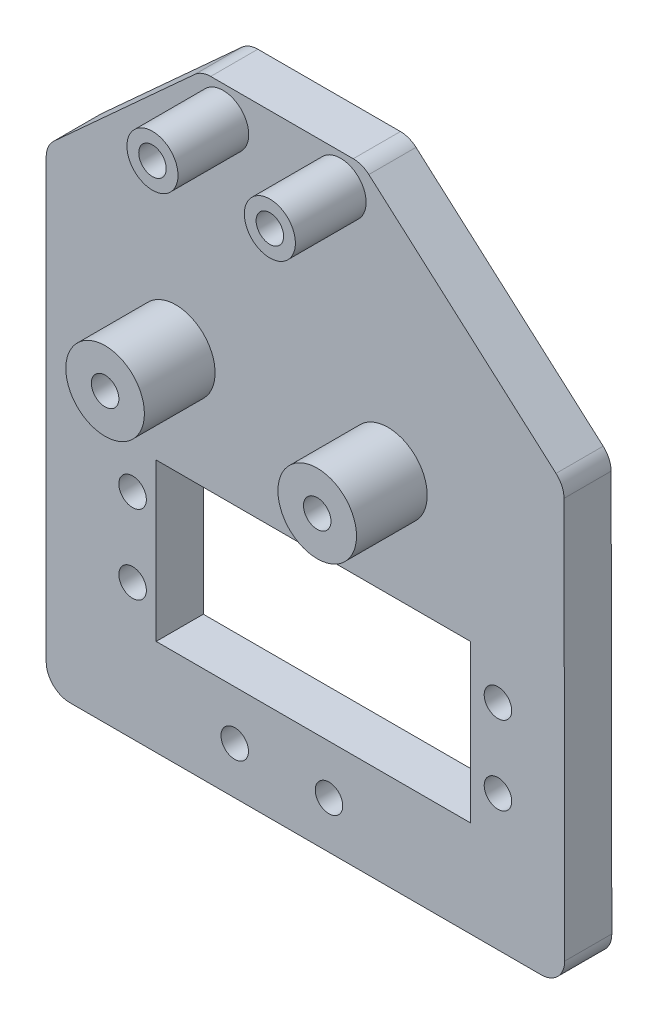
ISO-10303-21;
HEADER;
FILE_DESCRIPTION(('STEP AP214'),'2;1');
FILE_NAME('part.step','',(''),(''),'','','');
FILE_SCHEMA(('AUTOMOTIVE_DESIGN { 1 0 10303 214 1 1 1 1 }'));
ENDSEC;
DATA;
#1=APPLICATION_CONTEXT('core data for automotive mechanical design processes');
#2=APPLICATION_PROTOCOL_DEFINITION('international standard','automotive_design',2000,#1);
#3=PRODUCT_CONTEXT('',#1,'mechanical');
#4=PRODUCT('Part','Part','',(#3));
#5=PRODUCT_RELATED_PRODUCT_CATEGORY('part','',(#4));
#6=PRODUCT_DEFINITION_FORMATION('','',#4);
#7=PRODUCT_DEFINITION_CONTEXT('part definition',#1,'design');
#8=PRODUCT_DEFINITION('design','',#6,#7);
#9=PRODUCT_DEFINITION_SHAPE('','',#8);
#10=(LENGTH_UNIT() NAMED_UNIT(*) SI_UNIT(.MILLI.,.METRE.));
#11=(NAMED_UNIT(*) PLANE_ANGLE_UNIT() SI_UNIT($,.RADIAN.));
#12=(NAMED_UNIT(*) SI_UNIT($,.STERADIAN.) SOLID_ANGLE_UNIT());
#13=UNCERTAINTY_MEASURE_WITH_UNIT(LENGTH_MEASURE(1.E-05),#10,'distance_accuracy_value','');
#14=(GEOMETRIC_REPRESENTATION_CONTEXT(3) GLOBAL_UNCERTAINTY_ASSIGNED_CONTEXT((#13)) GLOBAL_UNIT_ASSIGNED_CONTEXT((#10,
#11,#12)) REPRESENTATION_CONTEXT('',''));
#15=CARTESIAN_POINT('',(0.,0.,0.));
#16=DIRECTION('',(0.,0.,1.));
#17=DIRECTION('',(1.,0.,0.));
#18=AXIS2_PLACEMENT_3D('',#15,#16,#17);
#19=CARTESIAN_POINT('',(0.,0.,3.));
#20=DIRECTION('',(0.,0.,-1.));
#21=DIRECTION('',(-1.,0.,0.));
#22=AXIS2_PLACEMENT_3D('',#19,#20,#21);
#23=PLANE('',#22);
#24=CARTESIAN_POINT('',(7.47053789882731,74.,3.));
#25=DIRECTION('',(0.,0.,-1.));
#26=DIRECTION('',(-1.,0.,0.));
#27=AXIS2_PLACEMENT_3D('',#24,#25,#26);
#28=CIRCLE('',#27,3.25);
#29=CARTESIAN_POINT('',(4.22053789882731,74.,3.));
#30=VERTEX_POINT('',#29);
#31=EDGE_CURVE('E282',#30,#30,#28,.F.);
#32=ORIENTED_EDGE('',*,*,#31,.F.);
#33=EDGE_LOOP('',(#32));
#34=FACE_BOUND('',#33,.T.);
#35=CARTESIAN_POINT('',(-7.47053789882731,74.,3.));
#36=DIRECTION('',(0.,0.,-1.));
#37=DIRECTION('',(-1.,0.,0.));
#38=AXIS2_PLACEMENT_3D('',#35,#36,#37);
#39=CIRCLE('',#38,3.25);
#40=CARTESIAN_POINT('',(-10.7205378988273,74.,3.));
#41=VERTEX_POINT('',#40);
#42=EDGE_CURVE('E279',#41,#41,#39,.F.);
#43=ORIENTED_EDGE('',*,*,#42,.F.);
#44=EDGE_LOOP('',(#43));
#45=FACE_BOUND('',#44,.T.);
#46=CARTESIAN_POINT('',(13.5,45.605,3.));
#47=DIRECTION('',(0.,0.,-1.));
#48=DIRECTION('',(-1.,0.,0.));
#49=AXIS2_PLACEMENT_3D('',#46,#47,#48);
#50=CIRCLE('',#49,5.);
#51=CARTESIAN_POINT('',(8.5,45.605,3.));
#52=VERTEX_POINT('',#51);
#53=EDGE_CURVE('E276',#52,#52,#50,.F.);
#54=ORIENTED_EDGE('',*,*,#53,.F.);
#55=EDGE_LOOP('',(#54));
#56=FACE_BOUND('',#55,.T.);
#57=CARTESIAN_POINT('',(-13.5,45.605,3.));
#58=DIRECTION('',(0.,0.,-1.));
#59=DIRECTION('',(-1.,0.,0.));
#60=AXIS2_PLACEMENT_3D('',#57,#58,#59);
#61=CIRCLE('',#60,5.);
#62=CARTESIAN_POINT('',(-18.5,45.605,3.));
#63=VERTEX_POINT('',#62);
#64=EDGE_CURVE('E258',#63,#63,#61,.F.);
#65=ORIENTED_EDGE('',*,*,#64,.F.);
#66=EDGE_LOOP('',(#65));
#67=FACE_BOUND('',#66,.T.);
#68=CARTESIAN_POINT('',(-19.,27.25,3.));
#69=DIRECTION('',(0.,0.,1.));
#70=DIRECTION('',(-1.,0.,0.));
#71=AXIS2_PLACEMENT_3D('',#68,#69,#70);
#72=CIRCLE('',#71,1.75);
#73=CARTESIAN_POINT('',(-20.75,27.25,3.));
#74=VERTEX_POINT('',#73);
#75=EDGE_CURVE('E198',#74,#74,#72,.T.);
#76=ORIENTED_EDGE('',*,*,#75,.F.);
#77=EDGE_LOOP('',(#76));
#78=FACE_BOUND('',#77,.T.);
#79=CARTESIAN_POINT('',(27.5,17.25,3.));
#80=DIRECTION('',(0.,0.,1.));
#81=DIRECTION('',(-1.,0.,0.));
#82=AXIS2_PLACEMENT_3D('',#79,#80,#81);
#83=CIRCLE('',#82,1.75);
#84=CARTESIAN_POINT('',(25.75,17.25,3.));
#85=VERTEX_POINT('',#84);
#86=EDGE_CURVE('E205',#85,#85,#83,.T.);
#87=ORIENTED_EDGE('',*,*,#86,.F.);
#88=EDGE_LOOP('',(#87));
#89=FACE_BOUND('',#88,.T.);
#90=CARTESIAN_POINT('',(-19.,17.25,3.));
#91=DIRECTION('',(0.,0.,1.));
#92=DIRECTION('',(1.,0.,0.));
#93=AXIS2_PLACEMENT_3D('',#90,#91,#92);
#94=CIRCLE('',#93,1.75);
#95=CARTESIAN_POINT('',(-17.25,17.25,3.));
#96=VERTEX_POINT('',#95);
#97=EDGE_CURVE('E183',#96,#96,#94,.T.);
#98=ORIENTED_EDGE('',*,*,#97,.F.);
#99=EDGE_LOOP('',(#98));
#100=FACE_BOUND('',#99,.T.);
#101=DIRECTION('',(1.,0.,0.));
#102=VECTOR('',#101,1.);
#103=CARTESIAN_POINT('',(-16.,12.25,3.));
#104=LINE('',#103,#102);
#105=CARTESIAN_POINT('',(-16.,12.25,3.));
#106=VERTEX_POINT('',#105);
#107=CARTESIAN_POINT('',(24.,12.25,3.));
#108=VERTEX_POINT('',#107);
#109=EDGE_CURVE('E179',#106,#108,#104,.T.);
#110=ORIENTED_EDGE('',*,*,#109,.F.);
#111=DIRECTION('',(0.,-1.,0.));
#112=VECTOR('',#111,1.);
#113=CARTESIAN_POINT('',(-16.,32.25,3.));
#114=LINE('',#113,#112);
#115=CARTESIAN_POINT('',(-16.,32.25,3.));
#116=VERTEX_POINT('',#115);
#117=EDGE_CURVE('E158',#116,#106,#114,.T.);
#118=ORIENTED_EDGE('',*,*,#117,.F.);
#119=DIRECTION('',(-1.,0.,0.));
#120=VECTOR('',#119,1.);
#121=CARTESIAN_POINT('',(-16.,32.25,3.));
#122=LINE('',#121,#120);
#123=CARTESIAN_POINT('',(24.,32.25,3.));
#124=VERTEX_POINT('',#123);
#125=EDGE_CURVE('E169',#124,#116,#122,.T.);
#126=ORIENTED_EDGE('',*,*,#125,.F.);
#127=DIRECTION('',(0.,1.,0.));
#128=VECTOR('',#127,1.);
#129=CARTESIAN_POINT('',(24.,32.25,3.));
#130=LINE('',#129,#128);
#131=EDGE_CURVE('E174',#108,#124,#130,.T.);
#132=ORIENTED_EDGE('',*,*,#131,.F.);
#133=EDGE_LOOP('',(#110,#118,#126,#132));
#134=FACE_BOUND('',#133,.T.);
#135=CARTESIAN_POINT('',(27.5,27.25,3.));
#136=DIRECTION('',(0.,0.,1.));
#137=DIRECTION('',(1.,0.,0.));
#138=AXIS2_PLACEMENT_3D('',#135,#136,#137);
#139=CIRCLE('',#138,1.75);
#140=CARTESIAN_POINT('',(29.25,27.25,3.));
#141=VERTEX_POINT('',#140);
#142=EDGE_CURVE('E201',#141,#141,#139,.T.);
#143=ORIENTED_EDGE('',*,*,#142,.F.);
#144=EDGE_LOOP('',(#143));
#145=FACE_BOUND('',#144,.T.);
#146=DIRECTION('',(-0.00168143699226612,0.999998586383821,0.));
#147=VECTOR('',#146,1.);
#148=CARTESIAN_POINT('',(35.9069763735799,55.3238065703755,3.));
#149=LINE('',#148,#147);
#150=CARTESIAN_POINT('',(35.9949472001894,3.00504431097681,3.));
#151=VERTEX_POINT('',#150);
#152=CARTESIAN_POINT('',(35.9092468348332,53.9734984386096,3.));
#153=VERTEX_POINT('',#152);
#154=EDGE_CURVE('E244',#151,#153,#149,.T.);
#155=ORIENTED_EDGE('',*,*,#154,.T.);
#156=CARTESIAN_POINT('',(32.9092510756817,53.9684541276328,3.));
#157=DIRECTION('',(0.,0.,-1.));
#158=DIRECTION('',(-1.,0.,0.));
#159=AXIS2_PLACEMENT_3D('',#156,#157,#158);
#160=CIRCLE('',#159,3.);
#161=CARTESIAN_POINT('',(34.8946913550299,56.2174598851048,3.));
#162=VERTEX_POINT('',#161);
#163=EDGE_CURVE('E316',#153,#162,#160,.F.);
#164=ORIENTED_EDGE('',*,*,#163,.T.);
#165=DIRECTION('',(-0.749668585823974,0.661813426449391,0.));
#166=VECTOR('',#165,1.);
#167=CARTESIAN_POINT('',(10.2205378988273,78.,3.));
#168=LINE('',#167,#166);
#169=CARTESIAN_POINT('',(11.0712259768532,77.2490057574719,3.));
#170=VERTEX_POINT('',#169);
#171=EDGE_CURVE('E248',#162,#170,#168,.T.);
#172=ORIENTED_EDGE('',*,*,#171,.T.);
#173=CARTESIAN_POINT('',(9.08578569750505,75.,3.));
#174=DIRECTION('',(0.,0.,-1.));
#175=DIRECTION('',(-1.,0.,0.));
#176=AXIS2_PLACEMENT_3D('',#173,#174,#175);
#177=CIRCLE('',#176,3.);
#178=CARTESIAN_POINT('',(9.08578569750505,78.,3.));
#179=VERTEX_POINT('',#178);
#180=EDGE_CURVE('E312',#170,#179,#177,.F.);
#181=ORIENTED_EDGE('',*,*,#180,.T.);
#182=DIRECTION('',(-1.,0.,0.));
#183=VECTOR('',#182,1.);
#184=CARTESIAN_POINT('',(-10.2205378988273,78.,3.));
#185=LINE('',#184,#183);
#186=CARTESIAN_POINT('',(-9.05982649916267,78.,3.));
#187=VERTEX_POINT('',#186);
#188=EDGE_CURVE('E251',#179,#187,#185,.T.);
#189=ORIENTED_EDGE('',*,*,#188,.T.);
#190=CARTESIAN_POINT('',(-9.05982649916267,75.,3.));
#191=DIRECTION('',(0.,0.,-1.));
#192=DIRECTION('',(-1.,0.,0.));
#193=AXIS2_PLACEMENT_3D('',#190,#191,#192);
#194=CIRCLE('',#193,3.);
#195=CARTESIAN_POINT('',(-11.0789913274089,77.2187774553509,3.));
#196=VERTEX_POINT('',#195);
#197=EDGE_CURVE('E309',#187,#196,#194,.F.);
#198=ORIENTED_EDGE('',*,*,#197,.T.);
#199=DIRECTION('',(-0.739592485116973,-0.673054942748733,0.));
#200=VECTOR('',#199,1.);
#201=CARTESIAN_POINT('',(-30.,60.,3.));
#202=LINE('',#201,#200);
#203=CARTESIAN_POINT('',(-29.0191648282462,60.8925941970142,3.));
#204=VERTEX_POINT('',#203);
#205=EDGE_CURVE('E254',#196,#204,#202,.T.);
#206=ORIENTED_EDGE('',*,*,#205,.T.);
#207=CARTESIAN_POINT('',(-27.,58.6738167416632,3.));
#208=DIRECTION('',(0.,0.,-1.));
#209=DIRECTION('',(-1.,0.,0.));
#210=AXIS2_PLACEMENT_3D('',#207,#208,#209);
#211=CIRCLE('',#210,3.);
#212=CARTESIAN_POINT('',(-30.,58.6738167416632,3.));
#213=VERTEX_POINT('',#212);
#214=EDGE_CURVE('E63',#204,#213,#211,.F.);
#215=ORIENTED_EDGE('',*,*,#214,.T.);
#216=DIRECTION('',(0.,-1.,0.));
#217=VECTOR('',#216,1.);
#218=CARTESIAN_POINT('',(-30.,30.,3.));
#219=LINE('',#218,#217);
#220=CARTESIAN_POINT('',(-30.,3.,3.));
#221=VERTEX_POINT('',#220);
#222=EDGE_CURVE('E256',#213,#221,#219,.T.);
#223=ORIENTED_EDGE('',*,*,#222,.T.);
#224=CARTESIAN_POINT('',(-27.,3.,3.));
#225=DIRECTION('',(0.,0.,-1.));
#226=DIRECTION('',(-1.,0.,0.));
#227=AXIS2_PLACEMENT_3D('',#224,#225,#226);
#228=CIRCLE('',#227,3.);
#229=CARTESIAN_POINT('',(-27.,0.,3.));
#230=VERTEX_POINT('',#229);
#231=EDGE_CURVE('E307',#221,#230,#228,.F.);
#232=ORIENTED_EDGE('',*,*,#231,.T.);
#233=DIRECTION('',(1.,0.,0.));
#234=VECTOR('',#233,1.);
#235=CARTESIAN_POINT('',(30.,0.,3.));
#236=LINE('',#235,#234);
#237=CARTESIAN_POINT('',(32.9949514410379,0.,3.));
#238=VERTEX_POINT('',#237);
#239=EDGE_CURVE('E241',#230,#238,#236,.T.);
#240=ORIENTED_EDGE('',*,*,#239,.T.);
#241=CARTESIAN_POINT('',(32.9949514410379,3.00000000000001,3.));
#242=DIRECTION('',(0.,0.,-1.));
#243=DIRECTION('',(-1.,0.,0.));
#244=AXIS2_PLACEMENT_3D('',#241,#242,#243);
#245=CIRCLE('',#244,3.);
#246=EDGE_CURVE('E314',#238,#151,#245,.F.);
#247=ORIENTED_EDGE('',*,*,#246,.T.);
#248=EDGE_LOOP('',(#155,#164,#172,#181,#189,#198,#206,#215,#223,#232,#240,#247));
#249=FACE_BOUND('',#248,.T.);
#250=CARTESIAN_POINT('',(-6.,6.,3.));
#251=DIRECTION('',(0.,0.,1.));
#252=DIRECTION('',(1.,0.,0.));
#253=AXIS2_PLACEMENT_3D('',#250,#251,#252);
#254=CIRCLE('',#253,1.75);
#255=CARTESIAN_POINT('',(-4.25,6.,3.));
#256=VERTEX_POINT('',#255);
#257=EDGE_CURVE('E232',#256,#256,#254,.T.);
#258=ORIENTED_EDGE('',*,*,#257,.F.);
#259=EDGE_LOOP('',(#258));
#260=FACE_BOUND('',#259,.T.);
#261=CARTESIAN_POINT('',(6.,6.,3.));
#262=DIRECTION('',(0.,0.,1.));
#263=DIRECTION('',(-1.,0.,0.));
#264=AXIS2_PLACEMENT_3D('',#261,#262,#263);
#265=CIRCLE('',#264,1.75);
#266=CARTESIAN_POINT('',(4.25,6.,3.));
#267=VERTEX_POINT('',#266);
#268=EDGE_CURVE('E223',#267,#267,#265,.T.);
#269=ORIENTED_EDGE('',*,*,#268,.F.);
#270=EDGE_LOOP('',(#269));
#271=FACE_BOUND('',#270,.T.);
#272=ADVANCED_FACE('F41',(#34,#45,#56,#67,#78,#89,#100,#134,#145,#249,#260,#271),#23,.F.);
#273=CARTESIAN_POINT('',(0.,0.,-3.));
#274=DIRECTION('',(0.,0.,-1.));
#275=DIRECTION('',(-1.,0.,0.));
#276=AXIS2_PLACEMENT_3D('',#273,#274,#275);
#277=PLANE('',#276);
#278=CARTESIAN_POINT('',(-19.,27.25,-3.));
#279=DIRECTION('',(0.,0.,1.));
#280=DIRECTION('',(-1.,0.,0.));
#281=AXIS2_PLACEMENT_3D('',#278,#279,#280);
#282=CIRCLE('',#281,1.75);
#283=CARTESIAN_POINT('',(-20.75,27.25,-3.));
#284=VERTEX_POINT('',#283);
#285=EDGE_CURVE('E202',#284,#284,#282,.T.);
#286=ORIENTED_EDGE('',*,*,#285,.T.);
#287=EDGE_LOOP('',(#286));
#288=FACE_BOUND('',#287,.T.);
#289=CARTESIAN_POINT('',(27.5,17.25,-3.));
#290=DIRECTION('',(0.,0.,1.));
#291=DIRECTION('',(-1.,0.,0.));
#292=AXIS2_PLACEMENT_3D('',#289,#290,#291);
#293=CIRCLE('',#292,1.75);
#294=CARTESIAN_POINT('',(25.75,17.25,-3.));
#295=VERTEX_POINT('',#294);
#296=EDGE_CURVE('E208',#295,#295,#293,.T.);
#297=ORIENTED_EDGE('',*,*,#296,.T.);
#298=EDGE_LOOP('',(#297));
#299=FACE_BOUND('',#298,.T.);
#300=CARTESIAN_POINT('',(-19.,17.25,-3.));
#301=DIRECTION('',(0.,0.,1.));
#302=DIRECTION('',(1.,0.,0.));
#303=AXIS2_PLACEMENT_3D('',#300,#301,#302);
#304=CIRCLE('',#303,1.75);
#305=CARTESIAN_POINT('',(-17.25,17.25,-3.));
#306=VERTEX_POINT('',#305);
#307=EDGE_CURVE('E180',#306,#306,#304,.T.);
#308=ORIENTED_EDGE('',*,*,#307,.T.);
#309=EDGE_LOOP('',(#308));
#310=FACE_BOUND('',#309,.T.);
#311=DIRECTION('',(0.,-1.,0.));
#312=VECTOR('',#311,1.);
#313=CARTESIAN_POINT('',(-16.,32.25,-3.));
#314=LINE('',#313,#312);
#315=CARTESIAN_POINT('',(-16.,32.25,-3.));
#316=VERTEX_POINT('',#315);
#317=CARTESIAN_POINT('',(-16.,12.25,-3.));
#318=VERTEX_POINT('',#317);
#319=EDGE_CURVE('E161',#316,#318,#314,.T.);
#320=ORIENTED_EDGE('',*,*,#319,.T.);
#321=DIRECTION('',(1.,0.,0.));
#322=VECTOR('',#321,1.);
#323=CARTESIAN_POINT('',(-16.,12.25,-3.));
#324=LINE('',#323,#322);
#325=CARTESIAN_POINT('',(24.,12.25,-3.));
#326=VERTEX_POINT('',#325);
#327=EDGE_CURVE('E194',#318,#326,#324,.T.);
#328=ORIENTED_EDGE('',*,*,#327,.T.);
#329=DIRECTION('',(0.,1.,0.));
#330=VECTOR('',#329,1.);
#331=CARTESIAN_POINT('',(24.,32.25,-3.));
#332=LINE('',#331,#330);
#333=CARTESIAN_POINT('',(24.,32.25,-3.));
#334=VERTEX_POINT('',#333);
#335=EDGE_CURVE('E190',#326,#334,#332,.T.);
#336=ORIENTED_EDGE('',*,*,#335,.T.);
#337=DIRECTION('',(-1.,0.,0.));
#338=VECTOR('',#337,1.);
#339=CARTESIAN_POINT('',(-16.,32.25,-3.));
#340=LINE('',#339,#338);
#341=EDGE_CURVE('E188',#334,#316,#340,.T.);
#342=ORIENTED_EDGE('',*,*,#341,.T.);
#343=EDGE_LOOP('',(#320,#328,#336,#342));
#344=FACE_BOUND('',#343,.T.);
#345=CARTESIAN_POINT('',(27.5,27.25,-3.));
#346=DIRECTION('',(0.,0.,1.));
#347=DIRECTION('',(1.,0.,0.));
#348=AXIS2_PLACEMENT_3D('',#345,#346,#347);
#349=CIRCLE('',#348,1.75);
#350=CARTESIAN_POINT('',(29.25,27.25,-3.));
#351=VERTEX_POINT('',#350);
#352=EDGE_CURVE('E211',#351,#351,#349,.T.);
#353=ORIENTED_EDGE('',*,*,#352,.T.);
#354=EDGE_LOOP('',(#353));
#355=FACE_BOUND('',#354,.T.);
#356=CARTESIAN_POINT('',(13.5,45.605,-3.));
#357=DIRECTION('',(0.,0.,1.));
#358=DIRECTION('',(-1.,0.,0.));
#359=AXIS2_PLACEMENT_3D('',#356,#357,#358);
#360=CIRCLE('',#359,1.75);
#361=CARTESIAN_POINT('',(11.75,45.605,-3.));
#362=VERTEX_POINT('',#361);
#363=EDGE_CURVE('E219',#362,#362,#360,.T.);
#364=ORIENTED_EDGE('',*,*,#363,.T.);
#365=EDGE_LOOP('',(#364));
#366=FACE_BOUND('',#365,.T.);
#367=CARTESIAN_POINT('',(-13.5,45.605,-3.));
#368=DIRECTION('',(0.,0.,1.));
#369=DIRECTION('',(1.,0.,0.));
#370=AXIS2_PLACEMENT_3D('',#367,#368,#369);
#371=CIRCLE('',#370,1.75);
#372=CARTESIAN_POINT('',(-11.75,45.605,-3.));
#373=VERTEX_POINT('',#372);
#374=EDGE_CURVE('E226',#373,#373,#371,.T.);
#375=ORIENTED_EDGE('',*,*,#374,.T.);
#376=EDGE_LOOP('',(#375));
#377=FACE_BOUND('',#376,.T.);
#378=CARTESIAN_POINT('',(-7.47053789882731,74.,-3.));
#379=DIRECTION('',(0.,0.,1.));
#380=DIRECTION('',(1.,0.,0.));
#381=AXIS2_PLACEMENT_3D('',#378,#379,#380);
#382=CIRCLE('',#381,1.75);
#383=CARTESIAN_POINT('',(-5.7205378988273,74.,-3.));
#384=VERTEX_POINT('',#383);
#385=EDGE_CURVE('E235',#384,#384,#382,.T.);
#386=ORIENTED_EDGE('',*,*,#385,.T.);
#387=EDGE_LOOP('',(#386));
#388=FACE_BOUND('',#387,.T.);
#389=DIRECTION('',(-0.749668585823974,0.661813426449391,0.));
#390=VECTOR('',#389,1.);
#391=CARTESIAN_POINT('',(10.2205378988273,78.,-3.));
#392=LINE('',#391,#390);
#393=CARTESIAN_POINT('',(34.8946913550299,56.2174598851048,-3.));
#394=VERTEX_POINT('',#393);
#395=CARTESIAN_POINT('',(11.0712259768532,77.2490057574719,-3.));
#396=VERTEX_POINT('',#395);
#397=EDGE_CURVE('E261',#394,#396,#392,.T.);
#398=ORIENTED_EDGE('',*,*,#397,.F.);
#399=CARTESIAN_POINT('',(32.9092510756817,53.9684541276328,-3.));
#400=DIRECTION('',(0.,0.,-1.));
#401=DIRECTION('',(-1.,0.,0.));
#402=AXIS2_PLACEMENT_3D('',#399,#400,#401);
#403=CIRCLE('',#402,3.);
#404=CARTESIAN_POINT('',(35.9092468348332,53.9734984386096,-3.));
#405=VERTEX_POINT('',#404);
#406=EDGE_CURVE('E300',#394,#405,#403,.T.);
#407=ORIENTED_EDGE('',*,*,#406,.T.);
#408=DIRECTION('',(-0.00168143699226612,0.999998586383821,0.));
#409=VECTOR('',#408,1.);
#410=CARTESIAN_POINT('',(35.9069763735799,55.3238065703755,-3.));
#411=LINE('',#410,#409);
#412=CARTESIAN_POINT('',(35.9949472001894,3.00504431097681,-3.));
#413=VERTEX_POINT('',#412);
#414=EDGE_CURVE('E240',#413,#405,#411,.T.);
#415=ORIENTED_EDGE('',*,*,#414,.F.);
#416=CARTESIAN_POINT('',(32.9949514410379,3.00000000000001,-3.));
#417=DIRECTION('',(0.,0.,-1.));
#418=DIRECTION('',(-1.,0.,0.));
#419=AXIS2_PLACEMENT_3D('',#416,#417,#418);
#420=CIRCLE('',#419,3.);
#421=CARTESIAN_POINT('',(32.9949514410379,0.,-3.));
#422=VERTEX_POINT('',#421);
#423=EDGE_CURVE('E298',#413,#422,#420,.T.);
#424=ORIENTED_EDGE('',*,*,#423,.T.);
#425=DIRECTION('',(1.,0.,0.));
#426=VECTOR('',#425,1.);
#427=CARTESIAN_POINT('',(0.,0.,-3.));
#428=LINE('',#427,#426);
#429=CARTESIAN_POINT('',(-27.,0.,-3.));
#430=VERTEX_POINT('',#429);
#431=EDGE_CURVE('E245',#430,#422,#428,.T.);
#432=ORIENTED_EDGE('',*,*,#431,.F.);
#433=CARTESIAN_POINT('',(-27.,3.,-3.));
#434=DIRECTION('',(0.,0.,-1.));
#435=DIRECTION('',(-1.,0.,0.));
#436=AXIS2_PLACEMENT_3D('',#433,#434,#435);
#437=CIRCLE('',#436,3.);
#438=CARTESIAN_POINT('',(-30.,3.,-3.));
#439=VERTEX_POINT('',#438);
#440=EDGE_CURVE('E290',#430,#439,#437,.T.);
#441=ORIENTED_EDGE('',*,*,#440,.T.);
#442=DIRECTION('',(0.,-1.,0.));
#443=VECTOR('',#442,1.);
#444=CARTESIAN_POINT('',(-30.,0.,-3.));
#445=LINE('',#444,#443);
#446=CARTESIAN_POINT('',(-30.,58.6738167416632,-3.));
#447=VERTEX_POINT('',#446);
#448=EDGE_CURVE('E270',#447,#439,#445,.T.);
#449=ORIENTED_EDGE('',*,*,#448,.F.);
#450=CARTESIAN_POINT('',(-27.,58.6738167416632,-3.));
#451=DIRECTION('',(0.,0.,-1.));
#452=DIRECTION('',(-1.,0.,0.));
#453=AXIS2_PLACEMENT_3D('',#450,#451,#452);
#454=CIRCLE('',#453,3.);
#455=CARTESIAN_POINT('',(-29.0191648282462,60.8925941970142,-3.));
#456=VERTEX_POINT('',#455);
#457=EDGE_CURVE('E294',#447,#456,#454,.T.);
#458=ORIENTED_EDGE('',*,*,#457,.T.);
#459=DIRECTION('',(-0.739592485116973,-0.673054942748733,0.));
#460=VECTOR('',#459,1.);
#461=CARTESIAN_POINT('',(-30.,60.,-3.));
#462=LINE('',#461,#460);
#463=CARTESIAN_POINT('',(-11.0789913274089,77.2187774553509,-3.));
#464=VERTEX_POINT('',#463);
#465=EDGE_CURVE('E267',#464,#456,#462,.T.);
#466=ORIENTED_EDGE('',*,*,#465,.F.);
#467=CARTESIAN_POINT('',(-9.05982649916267,75.,-3.));
#468=DIRECTION('',(0.,0.,-1.));
#469=DIRECTION('',(-1.,0.,0.));
#470=AXIS2_PLACEMENT_3D('',#467,#468,#469);
#471=CIRCLE('',#470,3.);
#472=CARTESIAN_POINT('',(-9.05982649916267,78.,-3.));
#473=VERTEX_POINT('',#472);
#474=EDGE_CURVE('E292',#464,#473,#471,.T.);
#475=ORIENTED_EDGE('',*,*,#474,.T.);
#476=DIRECTION('',(-1.,0.,0.));
#477=VECTOR('',#476,1.);
#478=CARTESIAN_POINT('',(-10.2205378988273,78.,-3.));
#479=LINE('',#478,#477);
#480=CARTESIAN_POINT('',(9.08578569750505,78.,-3.));
#481=VERTEX_POINT('',#480);
#482=EDGE_CURVE('E264',#481,#473,#479,.T.);
#483=ORIENTED_EDGE('',*,*,#482,.F.);
#484=CARTESIAN_POINT('',(9.08578569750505,75.,-3.));
#485=DIRECTION('',(0.,0.,-1.));
#486=DIRECTION('',(-1.,0.,0.));
#487=AXIS2_PLACEMENT_3D('',#484,#485,#486);
#488=CIRCLE('',#487,3.);
#489=EDGE_CURVE('E296',#481,#396,#488,.T.);
#490=ORIENTED_EDGE('',*,*,#489,.T.);
#491=EDGE_LOOP('',(#398,#407,#415,#424,#432,#441,#449,#458,#466,#475,#483,#490));
#492=FACE_BOUND('',#491,.T.);
#493=CARTESIAN_POINT('',(-6.,6.,-3.));
#494=DIRECTION('',(0.,0.,1.));
#495=DIRECTION('',(1.,0.,0.));
#496=AXIS2_PLACEMENT_3D('',#493,#494,#495);
#497=CIRCLE('',#496,1.75);
#498=CARTESIAN_POINT('',(-4.25,6.,-3.));
#499=VERTEX_POINT('',#498);
#500=EDGE_CURVE('E231',#499,#499,#497,.T.);
#501=ORIENTED_EDGE('',*,*,#500,.T.);
#502=EDGE_LOOP('',(#501));
#503=FACE_BOUND('',#502,.T.);
#504=CARTESIAN_POINT('',(6.,6.,-3.));
#505=DIRECTION('',(0.,0.,1.));
#506=DIRECTION('',(-1.,0.,0.));
#507=AXIS2_PLACEMENT_3D('',#504,#505,#506);
#508=CIRCLE('',#507,1.75);
#509=CARTESIAN_POINT('',(4.25,6.,-3.));
#510=VERTEX_POINT('',#509);
#511=EDGE_CURVE('E222',#510,#510,#508,.T.);
#512=ORIENTED_EDGE('',*,*,#511,.T.);
#513=EDGE_LOOP('',(#512));
#514=FACE_BOUND('',#513,.T.);
#515=CARTESIAN_POINT('',(7.47053789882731,74.,-3.));
#516=DIRECTION('',(0.,0.,1.));
#517=DIRECTION('',(-1.,0.,0.));
#518=AXIS2_PLACEMENT_3D('',#515,#516,#517);
#519=CIRCLE('',#518,1.75);
#520=CARTESIAN_POINT('',(5.7205378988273,74.,-3.));
#521=VERTEX_POINT('',#520);
#522=EDGE_CURVE('E214',#521,#521,#519,.T.);
#523=ORIENTED_EDGE('',*,*,#522,.T.);
#524=EDGE_LOOP('',(#523));
#525=FACE_BOUND('',#524,.T.);
#526=ADVANCED_FACE('F342',(#288,#299,#310,#344,#355,#366,#377,#388,#492,#503,#514,#525),#277,.T.);
#527=CARTESIAN_POINT('',(35.9069763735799,55.3238065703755,3.));
#528=DIRECTION('',(-0.999998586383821,-0.00168143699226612,0.));
#529=DIRECTION('',(0.00168143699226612,-0.999998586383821,0.));
#530=AXIS2_PLACEMENT_3D('',#527,#528,#529);
#531=PLANE('',#530);
#532=ORIENTED_EDGE('',*,*,#414,.T.);
#533=DIRECTION('',(0.,0.,-1.));
#534=VECTOR('',#533,1.);
#535=CARTESIAN_POINT('',(35.9092468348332,53.9734984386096,3.));
#536=LINE('',#535,#534);
#537=EDGE_CURVE('E305',#405,#153,#536,.F.);
#538=ORIENTED_EDGE('',*,*,#537,.T.);
#539=ORIENTED_EDGE('',*,*,#154,.F.);
#540=DIRECTION('',(0.,0.,-1.));
#541=VECTOR('',#540,1.);
#542=CARTESIAN_POINT('',(35.9949472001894,3.00504431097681,3.));
#543=LINE('',#542,#541);
#544=EDGE_CURVE('E302',#151,#413,#543,.T.);
#545=ORIENTED_EDGE('',*,*,#544,.T.);
#546=EDGE_LOOP('',(#532,#538,#539,#545));
#547=FACE_BOUND('',#546,.T.);
#548=ADVANCED_FACE('F366',(#547),#531,.F.);
#549=CARTESIAN_POINT('',(10.2205378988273,78.,3.));
#550=DIRECTION('',(-0.661813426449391,-0.749668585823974,0.));
#551=DIRECTION('',(0.749668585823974,-0.661813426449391,0.));
#552=AXIS2_PLACEMENT_3D('',#549,#550,#551);
#553=PLANE('',#552);
#554=ORIENTED_EDGE('',*,*,#171,.F.);
#555=DIRECTION('',(0.,0.,-1.));
#556=VECTOR('',#555,1.);
#557=CARTESIAN_POINT('',(34.8946913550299,56.2174598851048,3.));
#558=LINE('',#557,#556);
#559=EDGE_CURVE('E287',#162,#394,#558,.T.);
#560=ORIENTED_EDGE('',*,*,#559,.T.);
#561=ORIENTED_EDGE('',*,*,#397,.T.);
#562=DIRECTION('',(0.,0.,-1.));
#563=VECTOR('',#562,1.);
#564=CARTESIAN_POINT('',(11.0712259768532,77.2490057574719,3.));
#565=LINE('',#564,#563);
#566=EDGE_CURVE('E285',#396,#170,#565,.F.);
#567=ORIENTED_EDGE('',*,*,#566,.T.);
#568=EDGE_LOOP('',(#554,#560,#561,#567));
#569=FACE_BOUND('',#568,.T.);
#570=ADVANCED_FACE('F374',(#569),#553,.F.);
#571=CARTESIAN_POINT('',(-10.2205378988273,78.,3.));
#572=DIRECTION('',(0.,-1.,0.));
#573=DIRECTION('',(0.,0.,-1.));
#574=AXIS2_PLACEMENT_3D('',#571,#572,#573);
#575=PLANE('',#574);
#576=ORIENTED_EDGE('',*,*,#188,.F.);
#577=DIRECTION('',(0.,0.,-1.));
#578=VECTOR('',#577,1.);
#579=CARTESIAN_POINT('',(9.08578569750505,78.,3.));
#580=LINE('',#579,#578);
#581=EDGE_CURVE('E325',#179,#481,#580,.T.);
#582=ORIENTED_EDGE('',*,*,#581,.T.);
#583=ORIENTED_EDGE('',*,*,#482,.T.);
#584=DIRECTION('',(0.,0.,-1.));
#585=VECTOR('',#584,1.);
#586=CARTESIAN_POINT('',(-9.05982649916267,78.,3.));
#587=LINE('',#586,#585);
#588=EDGE_CURVE('E323',#473,#187,#587,.F.);
#589=ORIENTED_EDGE('',*,*,#588,.T.);
#590=EDGE_LOOP('',(#576,#582,#583,#589));
#591=FACE_BOUND('',#590,.T.);
#592=ADVANCED_FACE('F382',(#591),#575,.F.);
#593=CARTESIAN_POINT('',(-30.,60.,3.));
#594=DIRECTION('',(0.673054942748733,-0.739592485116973,0.));
#595=DIRECTION('',(0.739592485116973,0.673054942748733,0.));
#596=AXIS2_PLACEMENT_3D('',#593,#594,#595);
#597=PLANE('',#596);
#598=ORIENTED_EDGE('',*,*,#465,.T.);
#599=DIRECTION('',(0.,0.,-1.));
#600=VECTOR('',#599,1.);
#601=CARTESIAN_POINT('',(-29.0191648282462,60.8925941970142,3.));
#602=LINE('',#601,#600);
#603=EDGE_CURVE('E11',#456,#204,#602,.F.);
#604=ORIENTED_EDGE('',*,*,#603,.T.);
#605=ORIENTED_EDGE('',*,*,#205,.F.);
#606=DIRECTION('',(0.,0.,-1.));
#607=VECTOR('',#606,1.);
#608=CARTESIAN_POINT('',(-11.0789913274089,77.2187774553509,3.));
#609=LINE('',#608,#607);
#610=EDGE_CURVE('E49',#196,#464,#609,.T.);
#611=ORIENTED_EDGE('',*,*,#610,.T.);
#612=EDGE_LOOP('',(#598,#604,#605,#611));
#613=FACE_BOUND('',#612,.T.);
#614=ADVANCED_FACE('F336',(#613),#597,.F.);
#615=CARTESIAN_POINT('',(-30.,0.,3.));
#616=DIRECTION('',(1.,0.,0.));
#617=DIRECTION('',(0.,0.,-1.));
#618=AXIS2_PLACEMENT_3D('',#615,#616,#617);
#619=PLANE('',#618);
#620=ORIENTED_EDGE('',*,*,#222,.F.);
#621=DIRECTION('',(0.,0.,-1.));
#622=VECTOR('',#621,1.);
#623=CARTESIAN_POINT('',(-30.,58.6738167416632,3.));
#624=LINE('',#623,#622);
#625=EDGE_CURVE('E329',#213,#447,#624,.T.);
#626=ORIENTED_EDGE('',*,*,#625,.T.);
#627=ORIENTED_EDGE('',*,*,#448,.T.);
#628=DIRECTION('',(0.,0.,-1.));
#629=VECTOR('',#628,1.);
#630=CARTESIAN_POINT('',(-30.,3.,3.));
#631=LINE('',#630,#629);
#632=EDGE_CURVE('E56',#439,#221,#631,.F.);
#633=ORIENTED_EDGE('',*,*,#632,.T.);
#634=EDGE_LOOP('',(#620,#626,#627,#633));
#635=FACE_BOUND('',#634,.T.);
#636=ADVANCED_FACE('F349',(#635),#619,.F.);
#637=CARTESIAN_POINT('',(0.,0.,3.));
#638=DIRECTION('',(0.,1.,0.));
#639=DIRECTION('',(-1.,0.,0.));
#640=AXIS2_PLACEMENT_3D('',#637,#638,#639);
#641=PLANE('',#640);
#642=ORIENTED_EDGE('',*,*,#431,.T.);
#643=DIRECTION('',(0.,0.,-1.));
#644=VECTOR('',#643,1.);
#645=CARTESIAN_POINT('',(32.9949514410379,0.,3.));
#646=LINE('',#645,#644);
#647=EDGE_CURVE('E321',#422,#238,#646,.F.);
#648=ORIENTED_EDGE('',*,*,#647,.T.);
#649=ORIENTED_EDGE('',*,*,#239,.F.);
#650=DIRECTION('',(0.,0.,-1.));
#651=VECTOR('',#650,1.);
#652=CARTESIAN_POINT('',(-27.,0.,3.));
#653=LINE('',#652,#651);
#654=EDGE_CURVE('E318',#230,#430,#653,.T.);
#655=ORIENTED_EDGE('',*,*,#654,.T.);
#656=EDGE_LOOP('',(#642,#648,#649,#655));
#657=FACE_BOUND('',#656,.T.);
#658=ADVANCED_FACE('F357',(#657),#641,.F.);
#659=CARTESIAN_POINT('',(-7.47053789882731,74.,3.));
#660=DIRECTION('',(0.,0.,-1.));
#661=DIRECTION('',(-1.,0.,0.));
#662=AXIS2_PLACEMENT_3D('',#659,#660,#661);
#663=CYLINDRICAL_SURFACE('',#662,1.75);
#664=ORIENTED_EDGE('',*,*,#385,.F.);
#665=EDGE_LOOP('',(#664));
#666=FACE_BOUND('',#665,.T.);
#667=CARTESIAN_POINT('',(-7.47053789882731,74.,12.));
#668=DIRECTION('',(0.,0.,-1.));
#669=DIRECTION('',(-1.,0.,0.));
#670=AXIS2_PLACEMENT_3D('',#667,#668,#669);
#671=CIRCLE('',#670,1.75000000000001);
#672=CARTESIAN_POINT('',(-9.22053789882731,74.,12.));
#673=VERTEX_POINT('',#672);
#674=EDGE_CURVE('E812',#673,#673,#671,.T.);
#675=ORIENTED_EDGE('',*,*,#674,.F.);
#676=EDGE_LOOP('',(#675));
#677=FACE_BOUND('',#676,.T.);
#678=ADVANCED_FACE('F402',(#666,#677),#663,.F.);
#679=CARTESIAN_POINT('',(-6.,6.,3.));
#680=DIRECTION('',(0.,0.,-1.));
#681=DIRECTION('',(-1.,0.,0.));
#682=AXIS2_PLACEMENT_3D('',#679,#680,#681);
#683=CYLINDRICAL_SURFACE('',#682,1.75);
#684=ORIENTED_EDGE('',*,*,#257,.T.);
#685=EDGE_LOOP('',(#684));
#686=FACE_BOUND('',#685,.T.);
#687=ORIENTED_EDGE('',*,*,#500,.F.);
#688=EDGE_LOOP('',(#687));
#689=FACE_BOUND('',#688,.T.);
#690=ADVANCED_FACE('F659',(#686,#689),#683,.F.);
#691=CARTESIAN_POINT('',(-13.5,45.605,3.));
#692=DIRECTION('',(0.,0.,-1.));
#693=DIRECTION('',(-1.,0.,0.));
#694=AXIS2_PLACEMENT_3D('',#691,#692,#693);
#695=CYLINDRICAL_SURFACE('',#694,1.75);
#696=ORIENTED_EDGE('',*,*,#374,.F.);
#697=EDGE_LOOP('',(#696));
#698=FACE_BOUND('',#697,.T.);
#699=CARTESIAN_POINT('',(-13.5,45.605,12.));
#700=DIRECTION('',(0.,0.,1.));
#701=DIRECTION('',(1.,0.,0.));
#702=AXIS2_PLACEMENT_3D('',#699,#700,#701);
#703=CIRCLE('',#702,1.75);
#704=CARTESIAN_POINT('',(-11.75,45.605,12.));
#705=VERTEX_POINT('',#704);
#706=EDGE_CURVE('E825',#705,#705,#703,.T.);
#707=ORIENTED_EDGE('',*,*,#706,.T.);
#708=EDGE_LOOP('',(#707));
#709=FACE_BOUND('',#708,.T.);
#710=ADVANCED_FACE('F649',(#698,#709),#695,.F.);
#711=CARTESIAN_POINT('',(6.,6.,3.));
#712=DIRECTION('',(0.,0.,-1.));
#713=DIRECTION('',(-1.,0.,0.));
#714=AXIS2_PLACEMENT_3D('',#711,#712,#713);
#715=CYLINDRICAL_SURFACE('',#714,1.75);
#716=ORIENTED_EDGE('',*,*,#268,.T.);
#717=EDGE_LOOP('',(#716));
#718=FACE_BOUND('',#717,.T.);
#719=ORIENTED_EDGE('',*,*,#511,.F.);
#720=EDGE_LOOP('',(#719));
#721=FACE_BOUND('',#720,.T.);
#722=ADVANCED_FACE('F640',(#718,#721),#715,.F.);
#723=CARTESIAN_POINT('',(13.5,45.605,3.));
#724=DIRECTION('',(0.,0.,-1.));
#725=DIRECTION('',(-1.,0.,0.));
#726=AXIS2_PLACEMENT_3D('',#723,#724,#725);
#727=CYLINDRICAL_SURFACE('',#726,1.75);
#728=ORIENTED_EDGE('',*,*,#363,.F.);
#729=EDGE_LOOP('',(#728));
#730=FACE_BOUND('',#729,.T.);
#731=CARTESIAN_POINT('',(13.5,45.605,12.));
#732=DIRECTION('',(0.,0.,1.));
#733=DIRECTION('',(1.,0.,0.));
#734=AXIS2_PLACEMENT_3D('',#731,#732,#733);
#735=CIRCLE('',#734,1.75);
#736=CARTESIAN_POINT('',(15.25,45.605,12.));
#737=VERTEX_POINT('',#736);
#738=EDGE_CURVE('E824',#737,#737,#735,.T.);
#739=ORIENTED_EDGE('',*,*,#738,.T.);
#740=EDGE_LOOP('',(#739));
#741=FACE_BOUND('',#740,.T.);
#742=ADVANCED_FACE('F631',(#730,#741),#727,.F.);
#743=CARTESIAN_POINT('',(7.47053789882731,74.,3.));
#744=DIRECTION('',(0.,0.,-1.));
#745=DIRECTION('',(-1.,0.,0.));
#746=AXIS2_PLACEMENT_3D('',#743,#744,#745);
#747=CYLINDRICAL_SURFACE('',#746,1.75);
#748=ORIENTED_EDGE('',*,*,#522,.F.);
#749=EDGE_LOOP('',(#748));
#750=FACE_BOUND('',#749,.T.);
#751=CARTESIAN_POINT('',(7.47053789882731,74.,12.));
#752=DIRECTION('',(0.,0.,-1.));
#753=DIRECTION('',(-1.,0.,0.));
#754=AXIS2_PLACEMENT_3D('',#751,#752,#753);
#755=CIRCLE('',#754,1.75);
#756=CARTESIAN_POINT('',(5.7205378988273,74.,12.));
#757=VERTEX_POINT('',#756);
#758=EDGE_CURVE('E813',#757,#757,#755,.T.);
#759=ORIENTED_EDGE('',*,*,#758,.F.);
#760=EDGE_LOOP('',(#759));
#761=FACE_BOUND('',#760,.T.);
#762=ADVANCED_FACE('F621',(#750,#761),#747,.F.);
#763=CARTESIAN_POINT('',(27.5,27.25,-3.));
#764=DIRECTION('',(0.,0.,1.));
#765=DIRECTION('',(1.,0.,0.));
#766=AXIS2_PLACEMENT_3D('',#763,#764,#765);
#767=CYLINDRICAL_SURFACE('',#766,1.75);
#768=ORIENTED_EDGE('',*,*,#352,.F.);
#769=EDGE_LOOP('',(#768));
#770=FACE_BOUND('',#769,.T.);
#771=ORIENTED_EDGE('',*,*,#142,.T.);
#772=EDGE_LOOP('',(#771));
#773=FACE_BOUND('',#772,.T.);
#774=ADVANCED_FACE('F612',(#770,#773),#767,.F.);
#775=CARTESIAN_POINT('',(-16.,32.25,-3.));
#776=DIRECTION('',(-1.,0.,0.));
#777=DIRECTION('',(0.,0.,1.));
#778=AXIS2_PLACEMENT_3D('',#775,#776,#777);
#779=PLANE('',#778);
#780=ORIENTED_EDGE('',*,*,#117,.T.);
#781=DIRECTION('',(0.,0.,1.));
#782=VECTOR('',#781,1.);
#783=CARTESIAN_POINT('',(-16.,12.25,-3.));
#784=LINE('',#783,#782);
#785=EDGE_CURVE('E191',#318,#106,#784,.T.);
#786=ORIENTED_EDGE('',*,*,#785,.F.);
#787=ORIENTED_EDGE('',*,*,#319,.F.);
#788=DIRECTION('',(0.,0.,1.));
#789=VECTOR('',#788,1.);
#790=CARTESIAN_POINT('',(-16.,32.25,-3.));
#791=LINE('',#790,#789);
#792=EDGE_CURVE('E154',#316,#116,#791,.T.);
#793=ORIENTED_EDGE('',*,*,#792,.T.);
#794=EDGE_LOOP('',(#780,#786,#787,#793));
#795=FACE_BOUND('',#794,.T.);
#796=ADVANCED_FACE('F156',(#795),#779,.F.);
#797=CARTESIAN_POINT('',(-16.,32.25,-3.));
#798=DIRECTION('',(0.,1.,0.));
#799=DIRECTION('',(0.,0.,1.));
#800=AXIS2_PLACEMENT_3D('',#797,#798,#799);
#801=PLANE('',#800);
#802=ORIENTED_EDGE('',*,*,#125,.T.);
#803=ORIENTED_EDGE('',*,*,#792,.F.);
#804=ORIENTED_EDGE('',*,*,#341,.F.);
#805=DIRECTION('',(0.,0.,1.));
#806=VECTOR('',#805,1.);
#807=CARTESIAN_POINT('',(24.,32.25,-3.));
#808=LINE('',#807,#806);
#809=EDGE_CURVE('E165',#334,#124,#808,.T.);
#810=ORIENTED_EDGE('',*,*,#809,.T.);
#811=EDGE_LOOP('',(#802,#803,#804,#810));
#812=FACE_BOUND('',#811,.T.);
#813=ADVANCED_FACE('F170',(#812),#801,.F.);
#814=CARTESIAN_POINT('',(24.,32.25,-3.));
#815=DIRECTION('',(1.,0.,0.));
#816=DIRECTION('',(0.,0.,-1.));
#817=AXIS2_PLACEMENT_3D('',#814,#815,#816);
#818=PLANE('',#817);
#819=ORIENTED_EDGE('',*,*,#131,.T.);
#820=ORIENTED_EDGE('',*,*,#809,.F.);
#821=ORIENTED_EDGE('',*,*,#335,.F.);
#822=DIRECTION('',(0.,0.,1.));
#823=VECTOR('',#822,1.);
#824=CARTESIAN_POINT('',(24.,12.25,-3.));
#825=LINE('',#824,#823);
#826=EDGE_CURVE('E838',#326,#108,#825,.T.);
#827=ORIENTED_EDGE('',*,*,#826,.T.);
#828=EDGE_LOOP('',(#819,#820,#821,#827));
#829=FACE_BOUND('',#828,.T.);
#830=ADVANCED_FACE('F585',(#829),#818,.F.);
#831=CARTESIAN_POINT('',(-16.,12.25,-3.));
#832=DIRECTION('',(0.,-1.,0.));
#833=DIRECTION('',(1.,0.,0.));
#834=AXIS2_PLACEMENT_3D('',#831,#832,#833);
#835=PLANE('',#834);
#836=ORIENTED_EDGE('',*,*,#109,.T.);
#837=ORIENTED_EDGE('',*,*,#826,.F.);
#838=ORIENTED_EDGE('',*,*,#327,.F.);
#839=ORIENTED_EDGE('',*,*,#785,.T.);
#840=EDGE_LOOP('',(#836,#837,#838,#839));
#841=FACE_BOUND('',#840,.T.);
#842=ADVANCED_FACE('F575',(#841),#835,.F.);
#843=CARTESIAN_POINT('',(-19.,17.25,-3.));
#844=DIRECTION('',(0.,0.,1.));
#845=DIRECTION('',(1.,0.,0.));
#846=AXIS2_PLACEMENT_3D('',#843,#844,#845);
#847=CYLINDRICAL_SURFACE('',#846,1.75);
#848=ORIENTED_EDGE('',*,*,#307,.F.);
#849=EDGE_LOOP('',(#848));
#850=FACE_BOUND('',#849,.T.);
#851=ORIENTED_EDGE('',*,*,#97,.T.);
#852=EDGE_LOOP('',(#851));
#853=FACE_BOUND('',#852,.T.);
#854=ADVANCED_FACE('F565',(#850,#853),#847,.F.);
#855=CARTESIAN_POINT('',(27.5,17.25,-3.));
#856=DIRECTION('',(0.,0.,1.));
#857=DIRECTION('',(1.,0.,0.));
#858=AXIS2_PLACEMENT_3D('',#855,#856,#857);
#859=CYLINDRICAL_SURFACE('',#858,1.75);
#860=ORIENTED_EDGE('',*,*,#296,.F.);
#861=EDGE_LOOP('',(#860));
#862=FACE_BOUND('',#861,.T.);
#863=ORIENTED_EDGE('',*,*,#86,.T.);
#864=EDGE_LOOP('',(#863));
#865=FACE_BOUND('',#864,.T.);
#866=ADVANCED_FACE('F555',(#862,#865),#859,.F.);
#867=CARTESIAN_POINT('',(-19.,27.25,-3.));
#868=DIRECTION('',(0.,0.,1.));
#869=DIRECTION('',(1.,0.,0.));
#870=AXIS2_PLACEMENT_3D('',#867,#868,#869);
#871=CYLINDRICAL_SURFACE('',#870,1.75);
#872=ORIENTED_EDGE('',*,*,#285,.F.);
#873=EDGE_LOOP('',(#872));
#874=FACE_BOUND('',#873,.T.);
#875=ORIENTED_EDGE('',*,*,#75,.T.);
#876=EDGE_LOOP('',(#875));
#877=FACE_BOUND('',#876,.T.);
#878=ADVANCED_FACE('F545',(#874,#877),#871,.F.);
#879=CARTESIAN_POINT('',(-13.5,45.605,12.));
#880=DIRECTION('',(0.,0.,-1.));
#881=DIRECTION('',(-1.,0.,0.));
#882=AXIS2_PLACEMENT_3D('',#879,#880,#881);
#883=CYLINDRICAL_SURFACE('',#882,5.);
#884=CARTESIAN_POINT('',(-13.5,45.605,12.));
#885=DIRECTION('',(0.,0.,1.));
#886=DIRECTION('',(1.,0.,0.));
#887=AXIS2_PLACEMENT_3D('',#884,#885,#886);
#888=CIRCLE('',#887,5.);
#889=CARTESIAN_POINT('',(-8.5,45.605,12.));
#890=VERTEX_POINT('',#889);
#891=EDGE_CURVE('E166',#890,#890,#888,.T.);
#892=ORIENTED_EDGE('',*,*,#891,.F.);
#893=EDGE_LOOP('',(#892));
#894=FACE_BOUND('',#893,.T.);
#895=ORIENTED_EDGE('',*,*,#64,.T.);
#896=EDGE_LOOP('',(#895));
#897=FACE_BOUND('',#896,.T.);
#898=ADVANCED_FACE('F535',(#894,#897),#883,.T.);
#899=CARTESIAN_POINT('',(-13.5,45.605,12.));
#900=DIRECTION('',(0.,0.,1.));
#901=DIRECTION('',(1.,0.,0.));
#902=AXIS2_PLACEMENT_3D('',#899,#900,#901);
#903=PLANE('',#902);
#904=ORIENTED_EDGE('',*,*,#706,.F.);
#905=EDGE_LOOP('',(#904));
#906=FACE_BOUND('',#905,.T.);
#907=ORIENTED_EDGE('',*,*,#891,.T.);
#908=EDGE_LOOP('',(#907));
#909=FACE_BOUND('',#908,.T.);
#910=ADVANCED_FACE('F525',(#906,#909),#903,.T.);
#911=CARTESIAN_POINT('',(13.5,45.605,12.));
#912=DIRECTION('',(0.,0.,-1.));
#913=DIRECTION('',(-1.,0.,0.));
#914=AXIS2_PLACEMENT_3D('',#911,#912,#913);
#915=CYLINDRICAL_SURFACE('',#914,5.);
#916=CARTESIAN_POINT('',(13.5,45.605,12.));
#917=DIRECTION('',(0.,0.,1.));
#918=DIRECTION('',(1.,0.,0.));
#919=AXIS2_PLACEMENT_3D('',#916,#917,#918);
#920=CIRCLE('',#919,5.);
#921=CARTESIAN_POINT('',(18.5,45.605,12.));
#922=VERTEX_POINT('',#921);
#923=EDGE_CURVE('E828',#922,#922,#920,.T.);
#924=ORIENTED_EDGE('',*,*,#923,.F.);
#925=EDGE_LOOP('',(#924));
#926=FACE_BOUND('',#925,.T.);
#927=ORIENTED_EDGE('',*,*,#53,.T.);
#928=EDGE_LOOP('',(#927));
#929=FACE_BOUND('',#928,.T.);
#930=ADVANCED_FACE('F514',(#926,#929),#915,.T.);
#931=CARTESIAN_POINT('',(13.5,45.605,12.));
#932=DIRECTION('',(0.,0.,1.));
#933=DIRECTION('',(1.,0.,0.));
#934=AXIS2_PLACEMENT_3D('',#931,#932,#933);
#935=PLANE('',#934);
#936=ORIENTED_EDGE('',*,*,#738,.F.);
#937=EDGE_LOOP('',(#936));
#938=FACE_BOUND('',#937,.T.);
#939=ORIENTED_EDGE('',*,*,#923,.T.);
#940=EDGE_LOOP('',(#939));
#941=FACE_BOUND('',#940,.T.);
#942=ADVANCED_FACE('F503',(#938,#941),#935,.T.);
#943=CARTESIAN_POINT('',(-7.47053789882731,74.,12.));
#944=DIRECTION('',(0.,0.,-1.));
#945=DIRECTION('',(-1.,0.,0.));
#946=AXIS2_PLACEMENT_3D('',#943,#944,#945);
#947=CYLINDRICAL_SURFACE('',#946,3.25);
#948=CARTESIAN_POINT('',(-7.47053789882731,74.,12.));
#949=DIRECTION('',(0.,0.,1.));
#950=DIRECTION('',(1.,0.,0.));
#951=AXIS2_PLACEMENT_3D('',#948,#949,#950);
#952=CIRCLE('',#951,3.25);
#953=CARTESIAN_POINT('',(-4.22053789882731,74.,12.));
#954=VERTEX_POINT('',#953);
#955=EDGE_CURVE('E821',#954,#954,#952,.T.);
#956=ORIENTED_EDGE('',*,*,#955,.F.);
#957=EDGE_LOOP('',(#956));
#958=FACE_BOUND('',#957,.T.);
#959=ORIENTED_EDGE('',*,*,#42,.T.);
#960=EDGE_LOOP('',(#959));
#961=FACE_BOUND('',#960,.T.);
#962=ADVANCED_FACE('F493',(#958,#961),#947,.T.);
#963=CARTESIAN_POINT('',(-7.47053789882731,74.,12.));
#964=DIRECTION('',(0.,0.,1.));
#965=DIRECTION('',(1.,0.,0.));
#966=AXIS2_PLACEMENT_3D('',#963,#964,#965);
#967=PLANE('',#966);
#968=ORIENTED_EDGE('',*,*,#674,.T.);
#969=EDGE_LOOP('',(#968));
#970=FACE_BOUND('',#969,.T.);
#971=ORIENTED_EDGE('',*,*,#955,.T.);
#972=EDGE_LOOP('',(#971));
#973=FACE_BOUND('',#972,.T.);
#974=ADVANCED_FACE('F483',(#970,#973),#967,.T.);
#975=CARTESIAN_POINT('',(7.47053789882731,74.,12.));
#976=DIRECTION('',(0.,0.,-1.));
#977=DIRECTION('',(-1.,0.,0.));
#978=AXIS2_PLACEMENT_3D('',#975,#976,#977);
#979=CYLINDRICAL_SURFACE('',#978,3.25);
#980=CARTESIAN_POINT('',(7.47053789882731,74.,12.));
#981=DIRECTION('',(0.,0.,1.));
#982=DIRECTION('',(1.,0.,0.));
#983=AXIS2_PLACEMENT_3D('',#980,#981,#982);
#984=CIRCLE('',#983,3.25);
#985=CARTESIAN_POINT('',(10.7205378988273,74.,12.));
#986=VERTEX_POINT('',#985);
#987=EDGE_CURVE('E816',#986,#986,#984,.T.);
#988=ORIENTED_EDGE('',*,*,#987,.F.);
#989=EDGE_LOOP('',(#988));
#990=FACE_BOUND('',#989,.T.);
#991=ORIENTED_EDGE('',*,*,#31,.T.);
#992=EDGE_LOOP('',(#991));
#993=FACE_BOUND('',#992,.T.);
#994=ADVANCED_FACE('F472',(#990,#993),#979,.T.);
#995=CARTESIAN_POINT('',(7.47053789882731,74.,12.));
#996=DIRECTION('',(0.,0.,1.));
#997=DIRECTION('',(1.,0.,0.));
#998=AXIS2_PLACEMENT_3D('',#995,#996,#997);
#999=PLANE('',#998);
#1000=ORIENTED_EDGE('',*,*,#758,.T.);
#1001=EDGE_LOOP('',(#1000));
#1002=FACE_BOUND('',#1001,.T.);
#1003=ORIENTED_EDGE('',*,*,#987,.T.);
#1004=EDGE_LOOP('',(#1003));
#1005=FACE_BOUND('',#1004,.T.);
#1006=ADVANCED_FACE('F419',(#1002,#1005),#999,.T.);
#1007=CARTESIAN_POINT('',(32.9092510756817,53.9684541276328,3.));
#1008=DIRECTION('',(0.,0.,-1.));
#1009=DIRECTION('',(-1.,0.,0.));
#1010=AXIS2_PLACEMENT_3D('',#1007,#1008,#1009);
#1011=CYLINDRICAL_SURFACE('',#1010,3.);
#1012=ORIENTED_EDGE('',*,*,#163,.F.);
#1013=ORIENTED_EDGE('',*,*,#537,.F.);
#1014=ORIENTED_EDGE('',*,*,#406,.F.);
#1015=ORIENTED_EDGE('',*,*,#559,.F.);
#1016=EDGE_LOOP('',(#1012,#1013,#1014,#1015));
#1017=FACE_BOUND('',#1016,.T.);
#1018=ADVANCED_FACE('F372',(#1017),#1011,.T.);
#1019=CARTESIAN_POINT('',(32.9949514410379,3.00000000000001,3.));
#1020=DIRECTION('',(0.,0.,-1.));
#1021=DIRECTION('',(-1.,0.,0.));
#1022=AXIS2_PLACEMENT_3D('',#1019,#1020,#1021);
#1023=CYLINDRICAL_SURFACE('',#1022,3.);
#1024=ORIENTED_EDGE('',*,*,#246,.F.);
#1025=ORIENTED_EDGE('',*,*,#647,.F.);
#1026=ORIENTED_EDGE('',*,*,#423,.F.);
#1027=ORIENTED_EDGE('',*,*,#544,.F.);
#1028=EDGE_LOOP('',(#1024,#1025,#1026,#1027));
#1029=FACE_BOUND('',#1028,.T.);
#1030=ADVANCED_FACE('F363',(#1029),#1023,.T.);
#1031=CARTESIAN_POINT('',(9.08578569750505,75.,3.));
#1032=DIRECTION('',(0.,0.,-1.));
#1033=DIRECTION('',(-1.,0.,0.));
#1034=AXIS2_PLACEMENT_3D('',#1031,#1032,#1033);
#1035=CYLINDRICAL_SURFACE('',#1034,3.);
#1036=ORIENTED_EDGE('',*,*,#180,.F.);
#1037=ORIENTED_EDGE('',*,*,#566,.F.);
#1038=ORIENTED_EDGE('',*,*,#489,.F.);
#1039=ORIENTED_EDGE('',*,*,#581,.F.);
#1040=EDGE_LOOP('',(#1036,#1037,#1038,#1039));
#1041=FACE_BOUND('',#1040,.T.);
#1042=ADVANCED_FACE('F379',(#1041),#1035,.T.);
#1043=CARTESIAN_POINT('',(-27.,58.6738167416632,3.));
#1044=DIRECTION('',(0.,0.,-1.));
#1045=DIRECTION('',(-1.,0.,0.));
#1046=AXIS2_PLACEMENT_3D('',#1043,#1044,#1045);
#1047=CYLINDRICAL_SURFACE('',#1046,3.);
#1048=ORIENTED_EDGE('',*,*,#214,.F.);
#1049=ORIENTED_EDGE('',*,*,#603,.F.);
#1050=ORIENTED_EDGE('',*,*,#457,.F.);
#1051=ORIENTED_EDGE('',*,*,#625,.F.);
#1052=EDGE_LOOP('',(#1048,#1049,#1050,#1051));
#1053=FACE_BOUND('',#1052,.T.);
#1054=ADVANCED_FACE('F348',(#1053),#1047,.T.);
#1055=CARTESIAN_POINT('',(-9.05982649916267,75.,3.));
#1056=DIRECTION('',(0.,0.,-1.));
#1057=DIRECTION('',(-1.,0.,0.));
#1058=AXIS2_PLACEMENT_3D('',#1055,#1056,#1057);
#1059=CYLINDRICAL_SURFACE('',#1058,3.);
#1060=ORIENTED_EDGE('',*,*,#197,.F.);
#1061=ORIENTED_EDGE('',*,*,#588,.F.);
#1062=ORIENTED_EDGE('',*,*,#474,.F.);
#1063=ORIENTED_EDGE('',*,*,#610,.F.);
#1064=EDGE_LOOP('',(#1060,#1061,#1062,#1063));
#1065=FACE_BOUND('',#1064,.T.);
#1066=ADVANCED_FACE('F384',(#1065),#1059,.T.);
#1067=CARTESIAN_POINT('',(-27.,3.,3.));
#1068=DIRECTION('',(0.,0.,-1.));
#1069=DIRECTION('',(-1.,0.,0.));
#1070=AXIS2_PLACEMENT_3D('',#1067,#1068,#1069);
#1071=CYLINDRICAL_SURFACE('',#1070,3.);
#1072=ORIENTED_EDGE('',*,*,#231,.F.);
#1073=ORIENTED_EDGE('',*,*,#632,.F.);
#1074=ORIENTED_EDGE('',*,*,#440,.F.);
#1075=ORIENTED_EDGE('',*,*,#654,.F.);
#1076=EDGE_LOOP('',(#1072,#1073,#1074,#1075));
#1077=FACE_BOUND('',#1076,.T.);
#1078=ADVANCED_FACE('F43',(#1077),#1071,.T.);
#1079=CLOSED_SHELL('',(#272,#526,#548,#570,#592,#614,#636,#658,#678,#690,#710,#722,#742,#762,
#774,#796,#813,#830,#842,#854,#866,#878,#898,#910,#930,#942,#962,#974,#994,#1006,#1018,#1030,
#1042,#1054,#1066,#1078));
#1080=MANIFOLD_SOLID_BREP('B2',#1079);
#1081=ADVANCED_BREP_SHAPE_REPRESENTATION('',(#18,#1080),#14);
#1082=SHAPE_DEFINITION_REPRESENTATION(#9,#1081);
ENDSEC;
END-ISO-10303-21;
